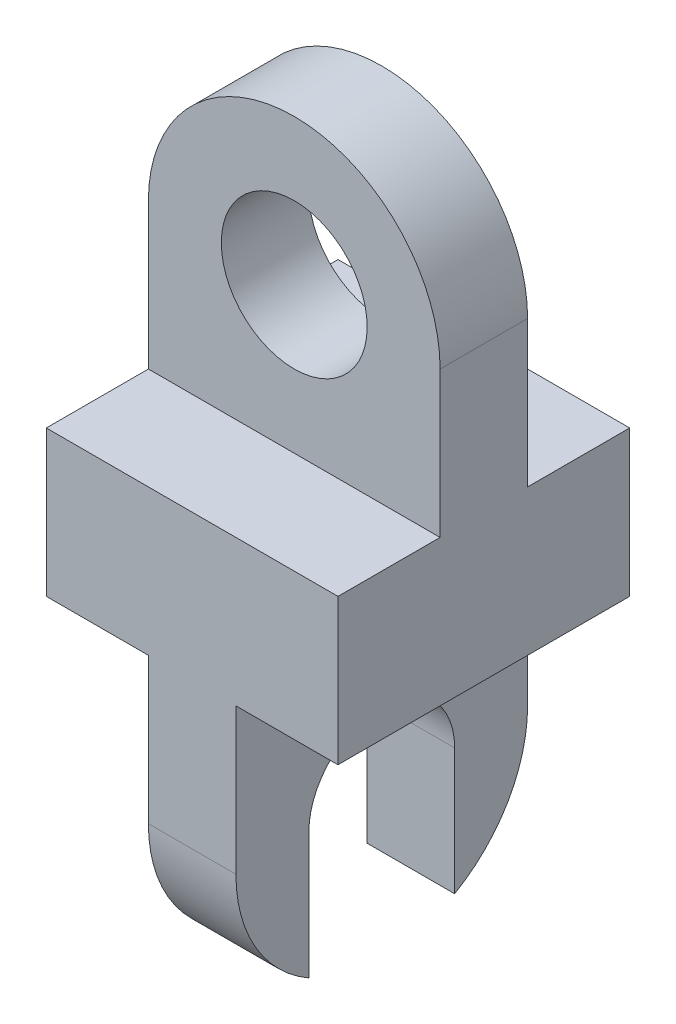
from build123d import *

# Parameters (mm, degrees)
SALIENTE_EXTRUIR1_DEPTH     = 100
CORTAR_EXTRUIR4_DEPTH       = 188.082869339
CORTAR_EXTRUIR4_DEPTH_BACK  = 35
CORTAR_EXTRUIR5_DEPTH       = 35
CORTAR_EXTRUIR6_DEPTH       = 171.953209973
CORTAR_EXTRUIR6_DEPTH_BACK  = 171.953209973
CROQUIS10_R                 = 25
CORTAR_EXTRUIR10_DEPTH      = 207.155281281
CORTAR_EXTRUIR10_DEPTH_BACK = 207.155281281
CROQUIS12_W                 = 100
CROQUIS12_H                 = 100
SALIENTE_EXTRUIR3_DEPTH     = 100
CROQUIS22_W                 = 100
CROQUIS22_H                 = 100
CORTAR_EXTRUIR12_DEPTH      = 35
CROQUIS23_W                 = 100
CROQUIS23_H                 = 100
CORTAR_EXTRUIR13_DEPTH      = 35
CORTAR_EXTRUIR14_DEPTH      = 192.637678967
CORTAR_EXTRUIR14_DEPTH_BACK = 192.637678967


with BuildPart() as part:
    # Croquis3 → Saliente-Extruir1 (new body)
    with BuildSketch(Plane.XY):
        with BuildLine():
            Line((-50, 100), (-50, -100))
            Line((-50, -100), (50, -100))
            Line((50, -100), (50, 100))
            ThreePointArc((50, 100), (0, 150), (-50, 100))
        make_face()
    extrude(amount=SALIENTE_EXTRUIR1_DEPTH)

    # Croquis8 → Cortar-Extruir4 (cut, two sides: drawn at the far end of the back side and taken through both)
    with BuildSketch(Plane.XY.offset(100).offset(-CORTAR_EXTRUIR4_DEPTH_BACK)):
        with BuildLine():
            Line((-50, 100), (-50, 50))
            Line((-50, 50), (50, 50))
            Line((50, 50), (50, 100))
            ThreePointArc((50, 100), (0, 150), (-50, 100))
        make_face()
    extrude(amount=CORTAR_EXTRUIR4_DEPTH + CORTAR_EXTRUIR4_DEPTH_BACK, mode=Mode.SUBTRACT)

    # Croquis9 → Cortar-Extruir5 (cut)
    with BuildSketch(Plane(origin=(0, 0, 0), x_dir=(-1, 0, 0), z_dir=(0, 0, -1))):
        with BuildLine():
            Line((-50, 100), (-50, 50))
            Line((-50, 50), (50, 50))
            Line((50, 50), (50, 100))
            ThreePointArc((50, 100), (0, 150), (-50, 100))
        make_face()
    extrude(amount=-CORTAR_EXTRUIR5_DEPTH, mode=Mode.SUBTRACT)

    # Croquis10 → Cortar-Extruir6 (cut, two sides: drawn at the far end of the back side and taken through both)
    with BuildSketch(Plane(origin=(0, 0, 35), x_dir=(-1, 0, 0), z_dir=(0, 0, -1)).offset(-CORTAR_EXTRUIR6_DEPTH_BACK)):
        with Locations((0, 100)):
            Circle(CROQUIS10_R)
    extrude(amount=CORTAR_EXTRUIR6_DEPTH + CORTAR_EXTRUIR6_DEPTH_BACK, mode=Mode.SUBTRACT)

    # Croquis12 → Cortar-Extruir10 (cut, two sides: drawn at the far end of the back side and taken through both)
    with BuildSketch(Plane.ZY.offset(50).offset(-CORTAR_EXTRUIR10_DEPTH_BACK)):
        with Locations((50, -50)):
            Rectangle(CROQUIS12_W, CROQUIS12_H)
    extrude(amount=CORTAR_EXTRUIR10_DEPTH + CORTAR_EXTRUIR10_DEPTH_BACK, mode=Mode.SUBTRACT)

    # Croquis17 → Saliente-Extruir3 (add)
    with BuildSketch(Plane.ZY.offset(50)):
        with BuildLine():
            Line((0, 0), (100, 0))
            Line((100, 0), (100, -50))
            ThreePointArc((100, -50), (50, -100), (0, -50))
            Line((0, -50), (0, 0))
        make_face()
    extrude(amount=-SALIENTE_EXTRUIR3_DEPTH)

    # Croquis22 → Cortar-Extruir12 (cut)
    with BuildSketch(Plane.ZY.offset(50)):
        with Locations((50, -50)):
            Rectangle(CROQUIS22_W, CROQUIS22_H)
    extrude(amount=-CORTAR_EXTRUIR12_DEPTH, mode=Mode.SUBTRACT)

    # Croquis23 → Cortar-Extruir13 (cut)
    with BuildSketch(Plane(origin=(50, 0, 0), x_dir=(0, 0, -1), z_dir=(1, 0, 0))):
        with Locations((-50, -50)):
            Rectangle(CROQUIS23_W, CROQUIS23_H)
    extrude(amount=-CORTAR_EXTRUIR13_DEPTH, mode=Mode.SUBTRACT)

    # Croquis24 → Cortar-Extruir14 (cut, two sides: drawn at the far end of the back side and taken through both)
    with BuildSketch(Plane.ZY.offset(15).offset(-CORTAR_EXTRUIR14_DEPTH_BACK)):
        with BuildLine():
            Line((25, -50), (25, -110.42880279))
            Line((25, -110.42880279), (75, -110.42880279))
            Line((75, -110.42880279), (75, -50))
            ThreePointArc((75, -50), (50, -25), (25, -50))
        make_face()
    extrude(amount=CORTAR_EXTRUIR14_DEPTH + CORTAR_EXTRUIR14_DEPTH_BACK, mode=Mode.SUBTRACT)


solid = part.part
